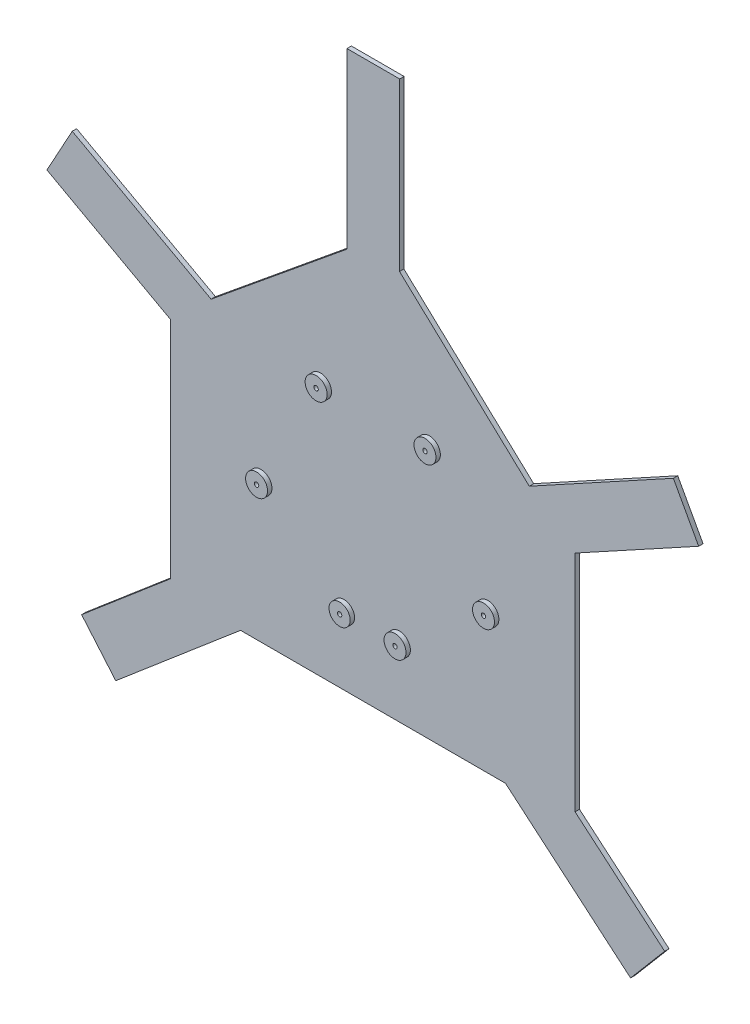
ISO-10303-21;
HEADER;
FILE_DESCRIPTION(('STEP AP214'),'2;1');
FILE_NAME('part.step','',(''),(''),'','','');
FILE_SCHEMA(('AUTOMOTIVE_DESIGN { 1 0 10303 214 1 1 1 1 }'));
ENDSEC;
DATA;
#1=APPLICATION_CONTEXT('core data for automotive mechanical design processes');
#2=APPLICATION_PROTOCOL_DEFINITION('international standard','automotive_design',2000,#1);
#3=PRODUCT_CONTEXT('',#1,'mechanical');
#4=PRODUCT('Part','Part','',(#3));
#5=PRODUCT_RELATED_PRODUCT_CATEGORY('part','',(#4));
#6=PRODUCT_DEFINITION_FORMATION('','',#4);
#7=PRODUCT_DEFINITION_CONTEXT('part definition',#1,'design');
#8=PRODUCT_DEFINITION('design','',#6,#7);
#9=PRODUCT_DEFINITION_SHAPE('','',#8);
#10=(LENGTH_UNIT() NAMED_UNIT(*) SI_UNIT(.MILLI.,.METRE.));
#11=(NAMED_UNIT(*) PLANE_ANGLE_UNIT() SI_UNIT($,.RADIAN.));
#12=(NAMED_UNIT(*) SI_UNIT($,.STERADIAN.) SOLID_ANGLE_UNIT());
#13=UNCERTAINTY_MEASURE_WITH_UNIT(LENGTH_MEASURE(1.E-05),#10,'distance_accuracy_value','');
#14=(GEOMETRIC_REPRESENTATION_CONTEXT(3) GLOBAL_UNCERTAINTY_ASSIGNED_CONTEXT((#13)) GLOBAL_UNIT_ASSIGNED_CONTEXT((#10,
#11,#12)) REPRESENTATION_CONTEXT('',''));
#15=CARTESIAN_POINT('',(0.,0.,0.));
#16=DIRECTION('',(0.,0.,1.));
#17=DIRECTION('',(1.,0.,0.));
#18=AXIS2_PLACEMENT_3D('',#15,#16,#17);
#19=CARTESIAN_POINT('',(0.,12.916249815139,1.));
#20=DIRECTION('',(0.,1.,0.));
#21=DIRECTION('',(-1.,0.,0.));
#22=AXIS2_PLACEMENT_3D('',#19,#20,#21);
#23=PLANE('',#22);
#24=DIRECTION('',(1.,0.,0.));
#25=VECTOR('',#24,1.);
#26=CARTESIAN_POINT('',(0.,12.916249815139,0.));
#27=LINE('',#26,#25);
#28=CARTESIAN_POINT('',(32.7776487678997,12.916249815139,0.));
#29=VERTEX_POINT('',#28);
#30=CARTESIAN_POINT('',(93.0898911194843,12.9162498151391,0.));
#31=VERTEX_POINT('',#30);
#32=EDGE_CURVE('E204',#29,#31,#27,.T.);
#33=ORIENTED_EDGE('',*,*,#32,.T.);
#34=DIRECTION('',(0.,0.,-1.));
#35=VECTOR('',#34,1.);
#36=CARTESIAN_POINT('',(93.0898911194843,12.9162498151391,1.));
#37=LINE('',#36,#35);
#38=CARTESIAN_POINT('',(93.0898911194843,12.9162498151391,1.));
#39=VERTEX_POINT('',#38);
#40=EDGE_CURVE('E11',#39,#31,#37,.T.);
#41=ORIENTED_EDGE('',*,*,#40,.F.);
#42=DIRECTION('',(1.,0.,0.));
#43=VECTOR('',#42,1.);
#44=CARTESIAN_POINT('',(0.,12.916249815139,1.));
#45=LINE('',#44,#43);
#46=CARTESIAN_POINT('',(32.7776487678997,12.916249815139,1.));
#47=VERTEX_POINT('',#46);
#48=EDGE_CURVE('E126',#47,#39,#45,.T.);
#49=ORIENTED_EDGE('',*,*,#48,.F.);
#50=DIRECTION('',(0.,0.,-1.));
#51=VECTOR('',#50,1.);
#52=CARTESIAN_POINT('',(32.7776487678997,12.916249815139,1.));
#53=LINE('',#52,#51);
#54=EDGE_CURVE('E203',#47,#29,#53,.T.);
#55=ORIENTED_EDGE('',*,*,#54,.T.);
#56=EDGE_LOOP('',(#33,#41,#49,#55));
#57=FACE_BOUND('',#56,.T.);
#58=ADVANCED_FACE('F35',(#57),#23,.F.);
#59=CARTESIAN_POINT('',(45.3070454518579,53.4326599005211,1.));
#60=DIRECTION('',(-0.646730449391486,-0.76271864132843,0.));
#61=DIRECTION('',(0.76271864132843,-0.646730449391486,0.));
#62=AXIS2_PLACEMENT_3D('',#59,#60,#61);
#63=PLANE('',#62);
#64=DIRECTION('',(-0.76271864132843,0.646730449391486,0.));
#65=VECTOR('',#64,1.);
#66=CARTESIAN_POINT('',(45.3070454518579,53.4326599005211,0.));
#67=LINE('',#66,#65);
#68=CARTESIAN_POINT('',(121.568198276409,-11.23130262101,0.));
#69=VERTEX_POINT('',#68);
#70=EDGE_CURVE('E207',#69,#31,#67,.T.);
#71=ORIENTED_EDGE('',*,*,#70,.F.);
#72=DIRECTION('',(0.,0.,-1.));
#73=VECTOR('',#72,1.);
#74=CARTESIAN_POINT('',(121.568198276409,-11.23130262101,1.));
#75=LINE('',#74,#73);
#76=CARTESIAN_POINT('',(121.568198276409,-11.23130262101,1.));
#77=VERTEX_POINT('',#76);
#78=EDGE_CURVE('E43',#77,#69,#75,.T.);
#79=ORIENTED_EDGE('',*,*,#78,.F.);
#80=DIRECTION('',(-0.76271864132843,0.646730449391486,0.));
#81=VECTOR('',#80,1.);
#82=CARTESIAN_POINT('',(45.3070454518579,53.4326599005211,1.));
#83=LINE('',#82,#81);
#84=EDGE_CURVE('E316',#77,#39,#83,.T.);
#85=ORIENTED_EDGE('',*,*,#84,.T.);
#86=ORIENTED_EDGE('',*,*,#40,.T.);
#87=EDGE_LOOP('',(#71,#79,#85,#86));
#88=FACE_BOUND('',#87,.T.);
#89=ADVANCED_FACE('F299',(#88),#63,.T.);
#90=CARTESIAN_POINT('',(76.2611528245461,-64.6639625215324,1.));
#91=DIRECTION('',(0.762718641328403,-0.646730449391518,0.));
#92=DIRECTION('',(0.646730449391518,0.762718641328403,0.));
#93=AXIS2_PLACEMENT_3D('',#90,#91,#92);
#94=PLANE('',#93);
#95=DIRECTION('',(-0.646730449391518,-0.762718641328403,0.));
#96=VECTOR('',#95,1.);
#97=CARTESIAN_POINT('',(76.2611528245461,-64.6639625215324,0.));
#98=LINE('',#97,#96);
#99=CARTESIAN_POINT('',(129.328963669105,-2.07867892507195,0.));
#100=VERTEX_POINT('',#99);
#101=EDGE_CURVE('E211',#100,#69,#98,.T.);
#102=ORIENTED_EDGE('',*,*,#101,.F.);
#103=DIRECTION('',(0.,0.,-1.));
#104=VECTOR('',#103,1.);
#105=CARTESIAN_POINT('',(129.328963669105,-2.07867892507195,1.));
#106=LINE('',#105,#104);
#107=CARTESIAN_POINT('',(129.328963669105,-2.07867892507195,1.));
#108=VERTEX_POINT('',#107);
#109=EDGE_CURVE('E289',#108,#100,#106,.T.);
#110=ORIENTED_EDGE('',*,*,#109,.F.);
#111=DIRECTION('',(-0.646730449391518,-0.762718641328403,0.));
#112=VECTOR('',#111,1.);
#113=CARTESIAN_POINT('',(76.2611528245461,-64.6639625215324,1.));
#114=LINE('',#113,#112);
#115=EDGE_CURVE('E296',#108,#77,#114,.T.);
#116=ORIENTED_EDGE('',*,*,#115,.T.);
#117=ORIENTED_EDGE('',*,*,#78,.T.);
#118=EDGE_LOOP('',(#102,#110,#116,#117));
#119=FACE_BOUND('',#118,.T.);
#120=ADVANCED_FACE('F294',(#119),#94,.T.);
#121=CARTESIAN_POINT('',(53.0678108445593,62.5852835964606,1.));
#122=DIRECTION('',(-0.646730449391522,-0.762718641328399,0.));
#123=DIRECTION('',(0.762718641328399,-0.646730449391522,0.));
#124=AXIS2_PLACEMENT_3D('',#121,#122,#123);
#125=PLANE('',#124);
#126=DIRECTION('',(-0.762718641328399,0.646730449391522,0.));
#127=VECTOR('',#126,1.);
#128=CARTESIAN_POINT('',(53.0678108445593,62.5852835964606,0.));
#129=LINE('',#128,#127);
#130=CARTESIAN_POINT('',(108.934318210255,15.2145108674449,0.));
#131=VERTEX_POINT('',#130);
#132=EDGE_CURVE('E214',#100,#131,#129,.T.);
#133=ORIENTED_EDGE('',*,*,#132,.T.);
#134=DIRECTION('',(0.,0.,-1.));
#135=VECTOR('',#134,1.);
#136=CARTESIAN_POINT('',(108.934318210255,15.2145108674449,1.));
#137=LINE('',#136,#135);
#138=CARTESIAN_POINT('',(108.934318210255,15.2145108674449,1.));
#139=VERTEX_POINT('',#138);
#140=EDGE_CURVE('E287',#139,#131,#137,.T.);
#141=ORIENTED_EDGE('',*,*,#140,.F.);
#142=DIRECTION('',(-0.762718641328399,0.646730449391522,0.));
#143=VECTOR('',#142,1.);
#144=CARTESIAN_POINT('',(53.0678108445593,62.5852835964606,1.));
#145=LINE('',#144,#143);
#146=EDGE_CURVE('E312',#108,#139,#145,.T.);
#147=ORIENTED_EDGE('',*,*,#146,.F.);
#148=ORIENTED_EDGE('',*,*,#109,.T.);
#149=EDGE_LOOP('',(#133,#141,#147,#148));
#150=FACE_BOUND('',#149,.T.);
#151=ADVANCED_FACE('F309',(#150),#125,.F.);
#152=CARTESIAN_POINT('',(108.934318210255,0.,1.));
#153=DIRECTION('',(1.,0.,0.));
#154=DIRECTION('',(0.,0.,-1.));
#155=AXIS2_PLACEMENT_3D('',#152,#153,#154);
#156=PLANE('',#155);
#157=DIRECTION('',(0.,-1.,0.));
#158=VECTOR('',#157,1.);
#159=CARTESIAN_POINT('',(108.934318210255,0.,0.));
#160=LINE('',#159,#158);
#161=CARTESIAN_POINT('',(108.934318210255,66.2255841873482,0.));
#162=VERTEX_POINT('',#161);
#163=EDGE_CURVE('E217',#162,#131,#160,.T.);
#164=ORIENTED_EDGE('',*,*,#163,.F.);
#165=DIRECTION('',(0.,0.,-1.));
#166=VECTOR('',#165,1.);
#167=CARTESIAN_POINT('',(108.934318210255,66.2255841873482,1.));
#168=LINE('',#167,#166);
#169=CARTESIAN_POINT('',(108.934318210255,66.2255841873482,1.));
#170=VERTEX_POINT('',#169);
#171=EDGE_CURVE('E285',#170,#162,#168,.T.);
#172=ORIENTED_EDGE('',*,*,#171,.F.);
#173=DIRECTION('',(0.,-1.,0.));
#174=VECTOR('',#173,1.);
#175=CARTESIAN_POINT('',(108.934318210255,0.,1.));
#176=LINE('',#175,#174);
#177=EDGE_CURVE('E314',#170,#139,#176,.T.);
#178=ORIENTED_EDGE('',*,*,#177,.T.);
#179=ORIENTED_EDGE('',*,*,#140,.T.);
#180=EDGE_LOOP('',(#164,#172,#178,#179));
#181=FACE_BOUND('',#180,.T.);
#182=ADVANCED_FACE('F789',(#181),#156,.T.);
#183=CARTESIAN_POINT('',(-2.76864157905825,5.0558581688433,1.));
#184=DIRECTION('',(-0.480308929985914,0.87709938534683,0.));
#185=DIRECTION('',(-0.87709938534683,-0.480308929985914,0.));
#186=AXIS2_PLACEMENT_3D('',#183,#184,#185);
#187=PLANE('',#186);
#188=DIRECTION('',(0.87709938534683,0.480308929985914,0.));
#189=VECTOR('',#188,1.);
#190=CARTESIAN_POINT('',(-2.76864157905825,5.0558581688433,0.));
#191=LINE('',#190,#189);
#192=CARTESIAN_POINT('',(137.073736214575,81.6350280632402,0.));
#193=VERTEX_POINT('',#192);
#194=EDGE_CURVE('E220',#162,#193,#191,.T.);
#195=ORIENTED_EDGE('',*,*,#194,.T.);
#196=DIRECTION('',(0.,0.,-1.));
#197=VECTOR('',#196,1.);
#198=CARTESIAN_POINT('',(137.073736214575,81.6350280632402,1.));
#199=LINE('',#198,#197);
#200=CARTESIAN_POINT('',(137.073736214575,81.6350280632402,1.));
#201=VERTEX_POINT('',#200);
#202=EDGE_CURVE('E283',#201,#193,#199,.T.);
#203=ORIENTED_EDGE('',*,*,#202,.F.);
#204=DIRECTION('',(0.87709938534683,0.480308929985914,0.));
#205=VECTOR('',#204,1.);
#206=CARTESIAN_POINT('',(-2.76864157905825,5.0558581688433,1.));
#207=LINE('',#206,#205);
#208=EDGE_CURVE('E322',#170,#201,#207,.T.);
#209=ORIENTED_EDGE('',*,*,#208,.F.);
#210=ORIENTED_EDGE('',*,*,#171,.T.);
#211=EDGE_LOOP('',(#195,#203,#209,#210));
#212=FACE_BOUND('',#211,.T.);
#213=ADVANCED_FACE('F779',(#212),#187,.F.);
#214=CARTESIAN_POINT('',(139.842377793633,76.5791698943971,1.));
#215=DIRECTION('',(0.877099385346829,0.480308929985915,0.));
#216=DIRECTION('',(-0.480308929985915,0.877099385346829,0.));
#217=AXIS2_PLACEMENT_3D('',#214,#215,#216);
#218=PLANE('',#217);
#219=DIRECTION('',(0.480308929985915,-0.877099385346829,0.));
#220=VECTOR('',#219,1.);
#221=CARTESIAN_POINT('',(139.842377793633,76.5791698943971,0.));
#222=LINE('',#221,#220);
#223=CARTESIAN_POINT('',(131.310029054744,92.1602206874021,0.));
#224=VERTEX_POINT('',#223);
#225=EDGE_CURVE('E223',#224,#193,#222,.T.);
#226=ORIENTED_EDGE('',*,*,#225,.F.);
#227=DIRECTION('',(0.,0.,-1.));
#228=VECTOR('',#227,1.);
#229=CARTESIAN_POINT('',(131.310029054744,92.1602206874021,1.));
#230=LINE('',#229,#228);
#231=CARTESIAN_POINT('',(131.310029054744,92.1602206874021,1.));
#232=VERTEX_POINT('',#231);
#233=EDGE_CURVE('E281',#232,#224,#230,.T.);
#234=ORIENTED_EDGE('',*,*,#233,.F.);
#235=DIRECTION('',(0.480308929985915,-0.877099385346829,0.));
#236=VECTOR('',#235,1.);
#237=CARTESIAN_POINT('',(139.842377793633,76.5791698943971,1.));
#238=LINE('',#237,#236);
#239=EDGE_CURVE('E324',#232,#201,#238,.T.);
#240=ORIENTED_EDGE('',*,*,#239,.T.);
#241=ORIENTED_EDGE('',*,*,#202,.T.);
#242=EDGE_LOOP('',(#226,#234,#240,#241));
#243=FACE_BOUND('',#242,.T.);
#244=ADVANCED_FACE('F768',(#243),#218,.T.);
#245=CARTESIAN_POINT('',(-8.53234873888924,15.5810507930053,1.));
#246=DIRECTION('',(-0.480308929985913,0.87709938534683,0.));
#247=DIRECTION('',(-0.87709938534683,-0.480308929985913,0.));
#248=AXIS2_PLACEMENT_3D('',#245,#246,#247);
#249=PLANE('',#248);
#250=DIRECTION('',(0.87709938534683,0.480308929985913,0.));
#251=VECTOR('',#250,1.);
#252=CARTESIAN_POINT('',(-8.53234873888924,15.5810507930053,0.));
#253=LINE('',#252,#251);
#254=CARTESIAN_POINT('',(98.5147792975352,74.2011939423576,0.));
#255=VERTEX_POINT('',#254);
#256=EDGE_CURVE('E226',#255,#224,#253,.T.);
#257=ORIENTED_EDGE('',*,*,#256,.F.);
#258=DIRECTION('',(0.,0.,-1.));
#259=VECTOR('',#258,1.);
#260=CARTESIAN_POINT('',(98.5147792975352,74.2011939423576,1.));
#261=LINE('',#260,#259);
#262=CARTESIAN_POINT('',(98.5147792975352,74.2011939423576,1.));
#263=VERTEX_POINT('',#262);
#264=EDGE_CURVE('E279',#263,#255,#261,.T.);
#265=ORIENTED_EDGE('',*,*,#264,.F.);
#266=DIRECTION('',(0.87709938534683,0.480308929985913,0.));
#267=VECTOR('',#266,1.);
#268=CARTESIAN_POINT('',(-8.53234873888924,15.5810507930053,1.));
#269=LINE('',#268,#267);
#270=EDGE_CURVE('E327',#263,#232,#269,.T.);
#271=ORIENTED_EDGE('',*,*,#270,.T.);
#272=ORIENTED_EDGE('',*,*,#233,.T.);
#273=EDGE_LOOP('',(#257,#265,#271,#272));
#274=FACE_BOUND('',#273,.T.);
#275=ADVANCED_FACE('F757',(#274),#249,.T.);
#276=CARTESIAN_POINT('',(82.8315829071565,88.8260092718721,1.));
#277=DIRECTION('',(0.681998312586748,0.731353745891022,0.));
#278=DIRECTION('',(-0.731353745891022,0.681998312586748,0.));
#279=AXIS2_PLACEMENT_3D('',#276,#277,#278);
#280=PLANE('',#279);
#281=DIRECTION('',(0.731353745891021,-0.681998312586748,0.));
#282=VECTOR('',#281,1.);
#283=CARTESIAN_POINT('',(82.8315829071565,88.8260092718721,0.));
#284=LINE('',#283,#282);
#285=CARTESIAN_POINT('',(68.9652836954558,101.756540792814,0.));
#286=VERTEX_POINT('',#285);
#287=EDGE_CURVE('E229',#286,#255,#284,.T.);
#288=ORIENTED_EDGE('',*,*,#287,.F.);
#289=DIRECTION('',(0.,0.,-1.));
#290=VECTOR('',#289,1.);
#291=CARTESIAN_POINT('',(68.9652836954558,101.756540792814,1.));
#292=LINE('',#291,#290);
#293=CARTESIAN_POINT('',(68.9652836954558,101.756540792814,1.));
#294=VERTEX_POINT('',#293);
#295=EDGE_CURVE('E277',#294,#286,#292,.T.);
#296=ORIENTED_EDGE('',*,*,#295,.F.);
#297=DIRECTION('',(0.731353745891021,-0.681998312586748,0.));
#298=VECTOR('',#297,1.);
#299=CARTESIAN_POINT('',(82.8315829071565,88.8260092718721,1.));
#300=LINE('',#299,#298);
#301=EDGE_CURVE('E330',#294,#263,#300,.T.);
#302=ORIENTED_EDGE('',*,*,#301,.T.);
#303=ORIENTED_EDGE('',*,*,#264,.T.);
#304=EDGE_LOOP('',(#288,#296,#302,#303));
#305=FACE_BOUND('',#304,.T.);
#306=ADVANCED_FACE('F747',(#305),#280,.T.);
#307=CARTESIAN_POINT('',(68.8422143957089,-0.0831930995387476,1.));
#308=DIRECTION('',(-0.999999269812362,0.00120845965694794,0.));
#309=DIRECTION('',(-0.00120845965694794,-0.999999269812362,0.));
#310=AXIS2_PLACEMENT_3D('',#307,#308,#309);
#311=PLANE('',#310);
#312=DIRECTION('',(0.00120845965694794,0.999999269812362,0.));
#313=VECTOR('',#312,1.);
#314=CARTESIAN_POINT('',(68.8422143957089,-0.0831930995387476,0.));
#315=LINE('',#314,#313);
#316=CARTESIAN_POINT('',(69.0111793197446,139.735128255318,0.));
#317=VERTEX_POINT('',#316);
#318=EDGE_CURVE('E232',#286,#317,#315,.T.);
#319=ORIENTED_EDGE('',*,*,#318,.T.);
#320=DIRECTION('',(0.,0.,-1.));
#321=VECTOR('',#320,1.);
#322=CARTESIAN_POINT('',(69.0111793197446,139.735128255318,1.));
#323=LINE('',#322,#321);
#324=CARTESIAN_POINT('',(69.0111793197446,139.735128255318,1.));
#325=VERTEX_POINT('',#324);
#326=EDGE_CURVE('E275',#325,#317,#323,.T.);
#327=ORIENTED_EDGE('',*,*,#326,.F.);
#328=DIRECTION('',(0.00120845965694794,0.999999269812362,0.));
#329=VECTOR('',#328,1.);
#330=CARTESIAN_POINT('',(68.8422143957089,-0.0831930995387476,1.));
#331=LINE('',#330,#329);
#332=EDGE_CURVE('E333',#294,#325,#331,.T.);
#333=ORIENTED_EDGE('',*,*,#332,.F.);
#334=ORIENTED_EDGE('',*,*,#295,.T.);
#335=EDGE_LOOP('',(#319,#327,#333,#334));
#336=FACE_BOUND('',#335,.T.);
#337=ADVANCED_FACE('F737',(#336),#311,.F.);
#338=CARTESIAN_POINT('',(0.,139.735128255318,1.));
#339=DIRECTION('',(0.,1.,0.));
#340=DIRECTION('',(0.,0.,1.));
#341=AXIS2_PLACEMENT_3D('',#338,#339,#340);
#342=PLANE('',#341);
#343=DIRECTION('',(1.,0.,0.));
#344=VECTOR('',#343,1.);
#345=CARTESIAN_POINT('',(0.,139.735128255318,0.));
#346=LINE('',#345,#344);
#347=CARTESIAN_POINT('',(57.0111705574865,139.735128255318,0.));
#348=VERTEX_POINT('',#347);
#349=EDGE_CURVE('E235',#348,#317,#346,.T.);
#350=ORIENTED_EDGE('',*,*,#349,.F.);
#351=DIRECTION('',(0.,0.,-1.));
#352=VECTOR('',#351,1.);
#353=CARTESIAN_POINT('',(57.0111705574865,139.735128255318,1.));
#354=LINE('',#353,#352);
#355=CARTESIAN_POINT('',(57.0111705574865,139.735128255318,1.));
#356=VERTEX_POINT('',#355);
#357=EDGE_CURVE('E273',#356,#348,#354,.T.);
#358=ORIENTED_EDGE('',*,*,#357,.F.);
#359=DIRECTION('',(1.,0.,0.));
#360=VECTOR('',#359,1.);
#361=CARTESIAN_POINT('',(0.,139.735128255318,1.));
#362=LINE('',#361,#360);
#363=EDGE_CURVE('E335',#356,#325,#362,.T.);
#364=ORIENTED_EDGE('',*,*,#363,.T.);
#365=ORIENTED_EDGE('',*,*,#326,.T.);
#366=EDGE_LOOP('',(#350,#358,#364,#365));
#367=FACE_BOUND('',#366,.T.);
#368=ADVANCED_FACE('F727',(#367),#342,.T.);
#369=CARTESIAN_POINT('',(56.8422231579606,-0.0686915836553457,1.));
#370=DIRECTION('',(-0.999999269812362,0.00120845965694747,0.));
#371=DIRECTION('',(-0.00120845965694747,-0.999999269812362,0.));
#372=AXIS2_PLACEMENT_3D('',#369,#370,#371);
#373=PLANE('',#372);
#374=DIRECTION('',(0.00120845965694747,0.999999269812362,0.));
#375=VECTOR('',#374,1.);
#376=CARTESIAN_POINT('',(56.8422231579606,-0.0686915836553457,0.));
#377=LINE('',#376,#375);
#378=CARTESIAN_POINT('',(56.9633273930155,100.144953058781,0.));
#379=VERTEX_POINT('',#378);
#380=EDGE_CURVE('E238',#379,#348,#377,.T.);
#381=ORIENTED_EDGE('',*,*,#380,.F.);
#382=DIRECTION('',(0.,0.,-1.));
#383=VECTOR('',#382,1.);
#384=CARTESIAN_POINT('',(56.9633273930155,100.144953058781,1.));
#385=LINE('',#384,#383);
#386=CARTESIAN_POINT('',(56.9633273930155,100.144953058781,1.));
#387=VERTEX_POINT('',#386);
#388=EDGE_CURVE('E271',#387,#379,#385,.T.);
#389=ORIENTED_EDGE('',*,*,#388,.F.);
#390=DIRECTION('',(0.00120845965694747,0.999999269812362,0.));
#391=VECTOR('',#390,1.);
#392=CARTESIAN_POINT('',(56.8422231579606,-0.0686915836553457,1.));
#393=LINE('',#392,#391);
#394=EDGE_CURVE('E338',#387,#356,#393,.T.);
#395=ORIENTED_EDGE('',*,*,#394,.T.);
#396=ORIENTED_EDGE('',*,*,#357,.T.);
#397=EDGE_LOOP('',(#381,#389,#395,#396));
#398=FACE_BOUND('',#397,.T.);
#399=ADVANCED_FACE('F716',(#398),#373,.T.);
#400=CARTESIAN_POINT('',(-26.2235755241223,32.0226877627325,1.));
#401=DIRECTION('',(-0.633573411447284,0.773682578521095,0.));
#402=DIRECTION('',(-0.773682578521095,-0.633573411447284,0.));
#403=AXIS2_PLACEMENT_3D('',#400,#401,#402);
#404=PLANE('',#403);
#405=DIRECTION('',(0.773682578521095,0.633573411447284,0.));
#406=VECTOR('',#405,1.);
#407=CARTESIAN_POINT('',(-26.2235755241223,32.0226877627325,0.));
#408=LINE('',#407,#406);
#409=CARTESIAN_POINT('',(26.0767204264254,74.8517210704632,0.));
#410=VERTEX_POINT('',#409);
#411=EDGE_CURVE('E241',#410,#379,#408,.T.);
#412=ORIENTED_EDGE('',*,*,#411,.F.);
#413=DIRECTION('',(0.,0.,-1.));
#414=VECTOR('',#413,1.);
#415=CARTESIAN_POINT('',(26.0767204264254,74.8517210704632,1.));
#416=LINE('',#415,#414);
#417=CARTESIAN_POINT('',(26.0767204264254,74.8517210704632,1.));
#418=VERTEX_POINT('',#417);
#419=EDGE_CURVE('E269',#418,#410,#416,.T.);
#420=ORIENTED_EDGE('',*,*,#419,.F.);
#421=DIRECTION('',(0.773682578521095,0.633573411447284,0.));
#422=VECTOR('',#421,1.);
#423=CARTESIAN_POINT('',(-26.2235755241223,32.0226877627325,1.));
#424=LINE('',#423,#422);
#425=EDGE_CURVE('E341',#418,#387,#424,.T.);
#426=ORIENTED_EDGE('',*,*,#425,.T.);
#427=ORIENTED_EDGE('',*,*,#388,.T.);
#428=EDGE_LOOP('',(#412,#420,#426,#427));
#429=FACE_BOUND('',#428,.T.);
#430=ADVANCED_FACE('F706',(#429),#404,.T.);
#431=CARTESIAN_POINT('',(37.5471036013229,68.5709303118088,1.));
#432=DIRECTION('',(-0.480278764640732,-0.877115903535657,0.));
#433=DIRECTION('',(0.877115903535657,-0.480278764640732,0.));
#434=AXIS2_PLACEMENT_3D('',#431,#432,#433);
#435=PLANE('',#434);
#436=DIRECTION('',(-0.877115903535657,0.480278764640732,0.));
#437=VECTOR('',#436,1.);
#438=CARTESIAN_POINT('',(37.5471036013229,68.5709303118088,0.));
#439=LINE('',#438,#437);
#440=CARTESIAN_POINT('',(-5.53344914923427,92.1603722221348,0.));
#441=VERTEX_POINT('',#440);
#442=EDGE_CURVE('E244',#410,#441,#439,.T.);
#443=ORIENTED_EDGE('',*,*,#442,.T.);
#444=DIRECTION('',(0.,0.,-1.));
#445=VECTOR('',#444,1.);
#446=CARTESIAN_POINT('',(-5.53344914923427,92.1603722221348,1.));
#447=LINE('',#446,#445);
#448=CARTESIAN_POINT('',(-5.53344914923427,92.1603722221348,1.));
#449=VERTEX_POINT('',#448);
#450=EDGE_CURVE('E266',#449,#441,#447,.T.);
#451=ORIENTED_EDGE('',*,*,#450,.F.);
#452=DIRECTION('',(-0.877115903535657,0.480278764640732,0.));
#453=VECTOR('',#452,1.);
#454=CARTESIAN_POINT('',(37.5471036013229,68.5709303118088,1.));
#455=LINE('',#454,#453);
#456=EDGE_CURVE('E344',#418,#449,#455,.T.);
#457=ORIENTED_EDGE('',*,*,#456,.F.);
#458=ORIENTED_EDGE('',*,*,#419,.T.);
#459=EDGE_LOOP('',(#443,#451,#457,#458));
#460=FACE_BOUND('',#459,.T.);
#461=ADVANCED_FACE('F697',(#460),#435,.F.);
#462=CARTESIAN_POINT('',(-43.0805527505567,23.5894419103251,1.));
#463=DIRECTION('',(0.877115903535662,-0.480278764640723,0.));
#464=DIRECTION('',(0.480278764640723,0.877115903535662,0.));
#465=AXIS2_PLACEMENT_3D('',#462,#463,#464);
#466=PLANE('',#465);
#467=DIRECTION('',(-0.480278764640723,-0.877115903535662,0.));
#468=VECTOR('',#467,1.);
#469=CARTESIAN_POINT('',(-43.0805527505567,23.5894419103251,0.));
#470=LINE('',#469,#468);
#471=CARTESIAN_POINT('',(-11.2967943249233,81.6349813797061,0.));
#472=VERTEX_POINT('',#471);
#473=EDGE_CURVE('E246',#441,#472,#470,.T.);
#474=ORIENTED_EDGE('',*,*,#473,.T.);
#475=DIRECTION('',(0.,0.,-1.));
#476=VECTOR('',#475,1.);
#477=CARTESIAN_POINT('',(-11.2967943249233,81.6349813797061,1.));
#478=LINE('',#477,#476);
#479=CARTESIAN_POINT('',(-11.2967943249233,81.6349813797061,1.));
#480=VERTEX_POINT('',#479);
#481=EDGE_CURVE('E264',#480,#472,#478,.T.);
#482=ORIENTED_EDGE('',*,*,#481,.F.);
#483=DIRECTION('',(-0.480278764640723,-0.877115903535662,0.));
#484=VECTOR('',#483,1.);
#485=CARTESIAN_POINT('',(-43.0805527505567,23.5894419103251,1.));
#486=LINE('',#485,#484);
#487=EDGE_CURVE('E346',#449,#480,#486,.T.);
#488=ORIENTED_EDGE('',*,*,#487,.F.);
#489=ORIENTED_EDGE('',*,*,#450,.T.);
#490=EDGE_LOOP('',(#474,#482,#488,#489));
#491=FACE_BOUND('',#490,.T.);
#492=ADVANCED_FACE('F357',(#491),#466,.F.);
#493=CARTESIAN_POINT('',(31.783758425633,58.0455394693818,1.));
#494=DIRECTION('',(-0.480278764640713,-0.877115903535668,0.));
#495=DIRECTION('',(0.877115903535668,-0.480278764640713,0.));
#496=AXIS2_PLACEMENT_3D('',#493,#494,#495);
#497=PLANE('',#496);
#498=DIRECTION('',(-0.877115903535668,0.480278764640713,0.));
#499=VECTOR('',#498,1.);
#500=CARTESIAN_POINT('',(31.783758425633,58.0455394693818,0.));
#501=LINE('',#500,#499);
#502=CARTESIAN_POINT('',(16.844878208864,66.2255609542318,0.));
#503=VERTEX_POINT('',#502);
#504=EDGE_CURVE('E249',#503,#472,#501,.T.);
#505=ORIENTED_EDGE('',*,*,#504,.F.);
#506=DIRECTION('',(0.,0.,-1.));
#507=VECTOR('',#506,1.);
#508=CARTESIAN_POINT('',(16.844878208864,66.2255609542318,1.));
#509=LINE('',#508,#507);
#510=CARTESIAN_POINT('',(16.844878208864,66.2255609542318,1.));
#511=VERTEX_POINT('',#510);
#512=EDGE_CURVE('E262',#511,#503,#509,.T.);
#513=ORIENTED_EDGE('',*,*,#512,.F.);
#514=DIRECTION('',(-0.877115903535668,0.480278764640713,0.));
#515=VECTOR('',#514,1.);
#516=CARTESIAN_POINT('',(31.783758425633,58.0455394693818,1.));
#517=LINE('',#516,#515);
#518=EDGE_CURVE('E198',#511,#480,#517,.T.);
#519=ORIENTED_EDGE('',*,*,#518,.T.);
#520=ORIENTED_EDGE('',*,*,#481,.T.);
#521=EDGE_LOOP('',(#505,#513,#519,#520));
#522=FACE_BOUND('',#521,.T.);
#523=ADVANCED_FACE('F350',(#522),#497,.T.);
#524=CARTESIAN_POINT('',(16.844878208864,0.,1.));
#525=DIRECTION('',(1.,0.,0.));
#526=DIRECTION('',(0.,1.,0.));
#527=AXIS2_PLACEMENT_3D('',#524,#525,#526);
#528=PLANE('',#527);
#529=DIRECTION('',(0.,-1.,0.));
#530=VECTOR('',#529,1.);
#531=CARTESIAN_POINT('',(16.844878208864,0.,0.));
#532=LINE('',#531,#530);
#533=CARTESIAN_POINT('',(16.844878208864,15.1251795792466,0.));
#534=VERTEX_POINT('',#533);
#535=EDGE_CURVE('E252',#503,#534,#532,.T.);
#536=ORIENTED_EDGE('',*,*,#535,.T.);
#537=DIRECTION('',(0.,0.,-1.));
#538=VECTOR('',#537,1.);
#539=CARTESIAN_POINT('',(16.844878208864,15.1251795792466,1.));
#540=LINE('',#539,#538);
#541=CARTESIAN_POINT('',(16.844878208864,15.1251795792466,1.));
#542=VERTEX_POINT('',#541);
#543=EDGE_CURVE('E186',#542,#534,#540,.T.);
#544=ORIENTED_EDGE('',*,*,#543,.F.);
#545=DIRECTION('',(0.,-1.,0.));
#546=VECTOR('',#545,1.);
#547=CARTESIAN_POINT('',(16.844878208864,0.,1.));
#548=LINE('',#547,#546);
#549=EDGE_CURVE('E195',#511,#542,#548,.T.);
#550=ORIENTED_EDGE('',*,*,#549,.F.);
#551=ORIENTED_EDGE('',*,*,#512,.T.);
#552=EDGE_LOOP('',(#536,#544,#550,#551));
#553=FACE_BOUND('',#552,.T.);
#554=ADVANCED_FACE('F362',(#553),#528,.F.);
#555=CARTESIAN_POINT('',(-0.400767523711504,0.471661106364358,1.));
#556=DIRECTION('',(-0.647512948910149,0.762054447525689,0.));
#557=DIRECTION('',(-0.762054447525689,-0.647512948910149,0.));
#558=AXIS2_PLACEMENT_3D('',#555,#556,#557);
#559=PLANE('',#558);
#560=DIRECTION('',(0.762054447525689,0.647512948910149,0.));
#561=VECTOR('',#560,1.);
#562=CARTESIAN_POINT('',(-0.400767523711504,0.471661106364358,0.));
#563=LINE('',#562,#561);
#564=CARTESIAN_POINT('',(-3.40395136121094,-2.08012561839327,0.));
#565=VERTEX_POINT('',#564);
#566=EDGE_CURVE('E185',#565,#534,#563,.T.);
#567=ORIENTED_EDGE('',*,*,#566,.F.);
#568=DIRECTION('',(0.,0.,-1.));
#569=VECTOR('',#568,1.);
#570=CARTESIAN_POINT('',(-3.40395136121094,-2.08012561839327,1.));
#571=LINE('',#570,#569);
#572=CARTESIAN_POINT('',(-3.40395136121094,-2.08012561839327,1.));
#573=VERTEX_POINT('',#572);
#574=EDGE_CURVE('E179',#573,#565,#571,.T.);
#575=ORIENTED_EDGE('',*,*,#574,.F.);
#576=DIRECTION('',(0.762054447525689,0.647512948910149,0.));
#577=VECTOR('',#576,1.);
#578=CARTESIAN_POINT('',(-0.400767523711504,0.471661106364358,1.));
#579=LINE('',#578,#577);
#580=EDGE_CURVE('E183',#573,#542,#579,.T.);
#581=ORIENTED_EDGE('',*,*,#580,.T.);
#582=ORIENTED_EDGE('',*,*,#543,.T.);
#583=EDGE_LOOP('',(#567,#575,#581,#582));
#584=FACE_BOUND('',#583,.T.);
#585=ADVANCED_FACE('F181',(#584),#559,.T.);
#586=CARTESIAN_POINT('',(-3.00318383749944,-2.55178672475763,1.));
#587=DIRECTION('',(0.762054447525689,0.647512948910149,0.));
#588=DIRECTION('',(-0.647512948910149,0.762054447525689,0.));
#589=AXIS2_PLACEMENT_3D('',#586,#587,#588);
#590=PLANE('',#589);
#591=DIRECTION('',(0.647512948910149,-0.762054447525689,0.));
#592=VECTOR('',#591,1.);
#593=CARTESIAN_POINT('',(-3.00318383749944,-2.55178672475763,0.));
#594=LINE('',#593,#592);
#595=CARTESIAN_POINT('',(4.36620402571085,-11.2247789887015,0.));
#596=VERTEX_POINT('',#595);
#597=EDGE_CURVE('E114',#565,#596,#594,.T.);
#598=ORIENTED_EDGE('',*,*,#597,.T.);
#599=DIRECTION('',(0.,0.,-1.));
#600=VECTOR('',#599,1.);
#601=CARTESIAN_POINT('',(4.36620402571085,-11.2247789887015,1.));
#602=LINE('',#601,#600);
#603=CARTESIAN_POINT('',(4.36620402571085,-11.2247789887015,1.));
#604=VERTEX_POINT('',#603);
#605=EDGE_CURVE('E187',#604,#596,#602,.T.);
#606=ORIENTED_EDGE('',*,*,#605,.F.);
#607=DIRECTION('',(0.647512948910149,-0.762054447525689,0.));
#608=VECTOR('',#607,1.);
#609=CARTESIAN_POINT('',(-3.00318383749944,-2.55178672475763,1.));
#610=LINE('',#609,#608);
#611=EDGE_CURVE('E189',#573,#604,#610,.T.);
#612=ORIENTED_EDGE('',*,*,#611,.F.);
#613=ORIENTED_EDGE('',*,*,#574,.T.);
#614=EDGE_LOOP('',(#598,#606,#612,#613));
#615=FACE_BOUND('',#614,.T.);
#616=ADVANCED_FACE('F190',(#615),#590,.F.);
#617=CARTESIAN_POINT('',(7.36938786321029,-8.67299226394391,1.));
#618=DIRECTION('',(-0.647512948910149,0.762054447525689,0.));
#619=DIRECTION('',(-0.762054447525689,-0.647512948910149,0.));
#620=AXIS2_PLACEMENT_3D('',#617,#618,#619);
#621=PLANE('',#620);
#622=DIRECTION('',(0.762054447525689,0.647512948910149,0.));
#623=VECTOR('',#622,1.);
#624=CARTESIAN_POINT('',(7.36938786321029,-8.67299226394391,0.));
#625=LINE('',#624,#623);
#626=EDGE_CURVE('E120',#596,#29,#625,.T.);
#627=ORIENTED_EDGE('',*,*,#626,.T.);
#628=ORIENTED_EDGE('',*,*,#54,.F.);
#629=DIRECTION('',(0.762054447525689,0.647512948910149,0.));
#630=VECTOR('',#629,1.);
#631=CARTESIAN_POINT('',(7.36938786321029,-8.67299226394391,1.));
#632=LINE('',#631,#630);
#633=EDGE_CURVE('E51',#604,#47,#632,.T.);
#634=ORIENTED_EDGE('',*,*,#633,.F.);
#635=ORIENTED_EDGE('',*,*,#605,.T.);
#636=EDGE_LOOP('',(#627,#628,#634,#635));
#637=FACE_BOUND('',#636,.T.);
#638=ADVANCED_FACE('F376',(#637),#621,.F.);
#639=CARTESIAN_POINT('',(0.,0.,1.));
#640=DIRECTION('',(0.,0.,1.));
#641=DIRECTION('',(1.,0.,0.));
#642=AXIS2_PLACEMENT_3D('',#639,#640,#641);
#643=PLANE('',#642);
#644=CARTESIAN_POINT('',(75.7671113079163,70.2664449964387,1.));
#645=DIRECTION('',(0.,0.,1.));
#646=DIRECTION('',(1.,0.,0.));
#647=AXIS2_PLACEMENT_3D('',#644,#645,#646);
#648=CIRCLE('',#647,2.5);
#649=CARTESIAN_POINT('',(78.2671113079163,70.2664449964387,1.));
#650=VERTEX_POINT('',#649);
#651=EDGE_CURVE('E258',#650,#650,#648,.T.);
#652=ORIENTED_EDGE('',*,*,#651,.F.);
#653=EDGE_LOOP('',(#652));
#654=FACE_BOUND('',#653,.T.);
#655=CARTESIAN_POINT('',(50.9833949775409,70.2664449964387,1.));
#656=DIRECTION('',(0.,0.,1.));
#657=DIRECTION('',(1.,0.,0.));
#658=AXIS2_PLACEMENT_3D('',#655,#656,#657);
#659=CIRCLE('',#658,2.5);
#660=CARTESIAN_POINT('',(53.4833949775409,70.2664449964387,1.));
#661=VERTEX_POINT('',#660);
#662=EDGE_CURVE('E522',#661,#661,#659,.T.);
#663=ORIENTED_EDGE('',*,*,#662,.F.);
#664=EDGE_LOOP('',(#663));
#665=FACE_BOUND('',#664,.T.);
#666=CARTESIAN_POINT('',(89.0901052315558,44.4687618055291,1.));
#667=DIRECTION('',(0.,0.,1.));
#668=DIRECTION('',(1.,0.,0.));
#669=AXIS2_PLACEMENT_3D('',#666,#667,#668);
#670=CIRCLE('',#669,2.5);
#671=CARTESIAN_POINT('',(91.5901052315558,44.4687618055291,1.));
#672=VERTEX_POINT('',#671);
#673=EDGE_CURVE('E525',#672,#672,#670,.T.);
#674=ORIENTED_EDGE('',*,*,#673,.F.);
#675=EDGE_LOOP('',(#674));
#676=FACE_BOUND('',#675,.T.);
#677=CARTESIAN_POINT('',(37.4272905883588,44.4687618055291,1.));
#678=DIRECTION('',(0.,0.,1.));
#679=DIRECTION('',(1.,0.,0.));
#680=AXIS2_PLACEMENT_3D('',#677,#678,#679);
#681=CIRCLE('',#680,2.5);
#682=CARTESIAN_POINT('',(39.9272905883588,44.4687618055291,1.));
#683=VERTEX_POINT('',#682);
#684=EDGE_CURVE('E528',#683,#683,#681,.T.);
#685=ORIENTED_EDGE('',*,*,#684,.F.);
#686=EDGE_LOOP('',(#685));
#687=FACE_BOUND('',#686,.T.);
#688=CARTESIAN_POINT('',(68.9454660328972,28.372721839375,1.));
#689=DIRECTION('',(0.,0.,1.));
#690=DIRECTION('',(1.,0.,0.));
#691=AXIS2_PLACEMENT_3D('',#688,#689,#690);
#692=CIRCLE('',#691,2.5);
#693=CARTESIAN_POINT('',(71.4454660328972,28.372721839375,1.));
#694=VERTEX_POINT('',#693);
#695=EDGE_CURVE('E531',#694,#694,#692,.T.);
#696=ORIENTED_EDGE('',*,*,#695,.F.);
#697=EDGE_LOOP('',(#696));
#698=FACE_BOUND('',#697,.T.);
#699=CARTESIAN_POINT('',(56.3281904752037,28.372721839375,1.));
#700=DIRECTION('',(0.,0.,1.));
#701=DIRECTION('',(1.,0.,0.));
#702=AXIS2_PLACEMENT_3D('',#699,#700,#701);
#703=CIRCLE('',#702,2.4085176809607);
#704=CARTESIAN_POINT('',(58.7367081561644,28.372721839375,1.));
#705=VERTEX_POINT('',#704);
#706=EDGE_CURVE('E534',#705,#705,#703,.T.);
#707=ORIENTED_EDGE('',*,*,#706,.F.);
#708=EDGE_LOOP('',(#707));
#709=FACE_BOUND('',#708,.T.);
#710=ORIENTED_EDGE('',*,*,#48,.T.);
#711=ORIENTED_EDGE('',*,*,#84,.F.);
#712=ORIENTED_EDGE('',*,*,#115,.F.);
#713=ORIENTED_EDGE('',*,*,#146,.T.);
#714=ORIENTED_EDGE('',*,*,#177,.F.);
#715=ORIENTED_EDGE('',*,*,#208,.T.);
#716=ORIENTED_EDGE('',*,*,#239,.F.);
#717=ORIENTED_EDGE('',*,*,#270,.F.);
#718=ORIENTED_EDGE('',*,*,#301,.F.);
#719=ORIENTED_EDGE('',*,*,#332,.T.);
#720=ORIENTED_EDGE('',*,*,#363,.F.);
#721=ORIENTED_EDGE('',*,*,#394,.F.);
#722=ORIENTED_EDGE('',*,*,#425,.F.);
#723=ORIENTED_EDGE('',*,*,#456,.T.);
#724=ORIENTED_EDGE('',*,*,#487,.T.);
#725=ORIENTED_EDGE('',*,*,#518,.F.);
#726=ORIENTED_EDGE('',*,*,#549,.T.);
#727=ORIENTED_EDGE('',*,*,#580,.F.);
#728=ORIENTED_EDGE('',*,*,#611,.T.);
#729=ORIENTED_EDGE('',*,*,#633,.T.);
#730=EDGE_LOOP('',(#710,#711,#712,#713,#714,#715,#716,#717,#718,#719,#720,#721,#722,#723,#724,
#725,#726,#727,#728,#729));
#731=FACE_BOUND('',#730,.T.);
#732=ADVANCED_FACE('F192',(#654,#665,#676,#687,#698,#709,#731),#643,.T.);
#733=CARTESIAN_POINT('',(0.,0.,0.));
#734=DIRECTION('',(0.,0.,1.));
#735=DIRECTION('',(1.,0.,0.));
#736=AXIS2_PLACEMENT_3D('',#733,#734,#735);
#737=PLANE('',#736);
#738=ORIENTED_EDGE('',*,*,#32,.F.);
#739=ORIENTED_EDGE('',*,*,#626,.F.);
#740=ORIENTED_EDGE('',*,*,#597,.F.);
#741=ORIENTED_EDGE('',*,*,#566,.T.);
#742=ORIENTED_EDGE('',*,*,#535,.F.);
#743=ORIENTED_EDGE('',*,*,#504,.T.);
#744=ORIENTED_EDGE('',*,*,#473,.F.);
#745=ORIENTED_EDGE('',*,*,#442,.F.);
#746=ORIENTED_EDGE('',*,*,#411,.T.);
#747=ORIENTED_EDGE('',*,*,#380,.T.);
#748=ORIENTED_EDGE('',*,*,#349,.T.);
#749=ORIENTED_EDGE('',*,*,#318,.F.);
#750=ORIENTED_EDGE('',*,*,#287,.T.);
#751=ORIENTED_EDGE('',*,*,#256,.T.);
#752=ORIENTED_EDGE('',*,*,#225,.T.);
#753=ORIENTED_EDGE('',*,*,#194,.F.);
#754=ORIENTED_EDGE('',*,*,#163,.T.);
#755=ORIENTED_EDGE('',*,*,#132,.F.);
#756=ORIENTED_EDGE('',*,*,#101,.T.);
#757=ORIENTED_EDGE('',*,*,#70,.T.);
#758=EDGE_LOOP('',(#738,#739,#740,#741,#742,#743,#744,#745,#746,#747,#748,#749,#750,#751,#752,
#753,#754,#755,#756,#757));
#759=FACE_BOUND('',#758,.T.);
#760=CARTESIAN_POINT('',(68.9454660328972,28.372721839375,0.));
#761=DIRECTION('',(0.,0.,1.));
#762=DIRECTION('',(1.,0.,0.));
#763=AXIS2_PLACEMENT_3D('',#760,#761,#762);
#764=CIRCLE('',#763,0.499999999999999);
#765=CARTESIAN_POINT('',(69.4454660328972,28.372721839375,0.));
#766=VERTEX_POINT('',#765);
#767=EDGE_CURVE('E510',#766,#766,#764,.T.);
#768=ORIENTED_EDGE('',*,*,#767,.T.);
#769=EDGE_LOOP('',(#768));
#770=FACE_BOUND('',#769,.T.);
#771=CARTESIAN_POINT('',(56.3281904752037,28.372721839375,0.));
#772=DIRECTION('',(0.,0.,1.));
#773=DIRECTION('',(1.,0.,0.));
#774=AXIS2_PLACEMENT_3D('',#771,#772,#773);
#775=CIRCLE('',#774,0.499999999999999);
#776=CARTESIAN_POINT('',(56.8281904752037,28.372721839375,0.));
#777=VERTEX_POINT('',#776);
#778=EDGE_CURVE('E501',#777,#777,#775,.T.);
#779=ORIENTED_EDGE('',*,*,#778,.T.);
#780=EDGE_LOOP('',(#779));
#781=FACE_BOUND('',#780,.T.);
#782=CARTESIAN_POINT('',(37.4272905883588,44.4687618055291,0.));
#783=DIRECTION('',(0.,0.,1.));
#784=DIRECTION('',(1.,0.,0.));
#785=AXIS2_PLACEMENT_3D('',#782,#783,#784);
#786=CIRCLE('',#785,0.499999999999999);
#787=CARTESIAN_POINT('',(37.9272905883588,44.4687618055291,0.));
#788=VERTEX_POINT('',#787);
#789=EDGE_CURVE('E492',#788,#788,#786,.T.);
#790=ORIENTED_EDGE('',*,*,#789,.T.);
#791=EDGE_LOOP('',(#790));
#792=FACE_BOUND('',#791,.T.);
#793=CARTESIAN_POINT('',(50.9833949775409,70.2664449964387,0.));
#794=DIRECTION('',(0.,0.,1.));
#795=DIRECTION('',(1.,0.,0.));
#796=AXIS2_PLACEMENT_3D('',#793,#794,#795);
#797=CIRCLE('',#796,0.499999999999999);
#798=CARTESIAN_POINT('',(51.4833949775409,70.2664449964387,0.));
#799=VERTEX_POINT('',#798);
#800=EDGE_CURVE('E484',#799,#799,#797,.T.);
#801=ORIENTED_EDGE('',*,*,#800,.T.);
#802=EDGE_LOOP('',(#801));
#803=FACE_BOUND('',#802,.T.);
#804=CARTESIAN_POINT('',(75.7671113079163,70.2664449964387,0.));
#805=DIRECTION('',(0.,0.,1.));
#806=DIRECTION('',(1.,0.,0.));
#807=AXIS2_PLACEMENT_3D('',#804,#805,#806);
#808=CIRCLE('',#807,0.499999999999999);
#809=CARTESIAN_POINT('',(76.2671113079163,70.2664449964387,0.));
#810=VERTEX_POINT('',#809);
#811=EDGE_CURVE('E470',#810,#810,#808,.T.);
#812=ORIENTED_EDGE('',*,*,#811,.T.);
#813=EDGE_LOOP('',(#812));
#814=FACE_BOUND('',#813,.T.);
#815=CARTESIAN_POINT('',(89.0901052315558,44.4687618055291,0.));
#816=DIRECTION('',(0.,0.,1.));
#817=DIRECTION('',(1.,0.,0.));
#818=AXIS2_PLACEMENT_3D('',#815,#816,#817);
#819=CIRCLE('',#818,0.499999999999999);
#820=CARTESIAN_POINT('',(89.5901052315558,44.4687618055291,0.));
#821=VERTEX_POINT('',#820);
#822=EDGE_CURVE('E475',#821,#821,#819,.T.);
#823=ORIENTED_EDGE('',*,*,#822,.T.);
#824=EDGE_LOOP('',(#823));
#825=FACE_BOUND('',#824,.T.);
#826=ADVANCED_FACE('F303',(#759,#770,#781,#792,#803,#814,#825),#737,.F.);
#827=CARTESIAN_POINT('',(68.9454660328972,28.372721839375,2.));
#828=DIRECTION('',(0.,0.,-1.));
#829=DIRECTION('',(-1.,0.,0.));
#830=AXIS2_PLACEMENT_3D('',#827,#828,#829);
#831=CYLINDRICAL_SURFACE('',#830,0.499999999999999);
#832=CARTESIAN_POINT('',(68.9454660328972,28.372721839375,2.));
#833=DIRECTION('',(0.,0.,1.));
#834=DIRECTION('',(1.,0.,0.));
#835=AXIS2_PLACEMENT_3D('',#832,#833,#834);
#836=CIRCLE('',#835,0.499999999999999);
#837=CARTESIAN_POINT('',(69.4454660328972,28.372721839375,2.));
#838=VERTEX_POINT('',#837);
#839=EDGE_CURVE('E513',#838,#838,#836,.T.);
#840=ORIENTED_EDGE('',*,*,#839,.T.);
#841=EDGE_LOOP('',(#840));
#842=FACE_BOUND('',#841,.T.);
#843=ORIENTED_EDGE('',*,*,#767,.F.);
#844=EDGE_LOOP('',(#843));
#845=FACE_BOUND('',#844,.T.);
#846=ADVANCED_FACE('F388',(#842,#845),#831,.F.);
#847=CARTESIAN_POINT('',(68.9454660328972,28.372721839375,2.));
#848=DIRECTION('',(0.,0.,-1.));
#849=DIRECTION('',(-1.,0.,0.));
#850=AXIS2_PLACEMENT_3D('',#847,#848,#849);
#851=CYLINDRICAL_SURFACE('',#850,2.5);
#852=ORIENTED_EDGE('',*,*,#695,.T.);
#853=EDGE_LOOP('',(#852));
#854=FACE_BOUND('',#853,.T.);
#855=CARTESIAN_POINT('',(68.9454660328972,28.372721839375,2.));
#856=DIRECTION('',(0.,0.,1.));
#857=DIRECTION('',(1.,0.,0.));
#858=AXIS2_PLACEMENT_3D('',#855,#856,#857);
#859=CIRCLE('',#858,2.5);
#860=CARTESIAN_POINT('',(71.4454660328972,28.372721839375,2.));
#861=VERTEX_POINT('',#860);
#862=EDGE_CURVE('E208',#861,#861,#859,.T.);
#863=ORIENTED_EDGE('',*,*,#862,.F.);
#864=EDGE_LOOP('',(#863));
#865=FACE_BOUND('',#864,.T.);
#866=ADVANCED_FACE('F392',(#854,#865),#851,.T.);
#867=CARTESIAN_POINT('',(0.,0.,2.));
#868=DIRECTION('',(0.,0.,1.));
#869=DIRECTION('',(1.,0.,0.));
#870=AXIS2_PLACEMENT_3D('',#867,#868,#869);
#871=PLANE('',#870);
#872=ORIENTED_EDGE('',*,*,#839,.F.);
#873=EDGE_LOOP('',(#872));
#874=FACE_BOUND('',#873,.T.);
#875=ORIENTED_EDGE('',*,*,#862,.T.);
#876=EDGE_LOOP('',(#875));
#877=FACE_BOUND('',#876,.T.);
#878=ADVANCED_FACE('F396',(#874,#877),#871,.T.);
#879=CARTESIAN_POINT('',(56.3281904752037,28.372721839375,2.));
#880=DIRECTION('',(0.,0.,-1.));
#881=DIRECTION('',(-1.,0.,0.));
#882=AXIS2_PLACEMENT_3D('',#879,#880,#881);
#883=CYLINDRICAL_SURFACE('',#882,0.499999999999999);
#884=CARTESIAN_POINT('',(56.3281904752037,28.372721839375,2.));
#885=DIRECTION('',(0.,0.,1.));
#886=DIRECTION('',(1.,0.,0.));
#887=AXIS2_PLACEMENT_3D('',#884,#885,#886);
#888=CIRCLE('',#887,0.499999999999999);
#889=CARTESIAN_POINT('',(56.8281904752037,28.372721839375,2.));
#890=VERTEX_POINT('',#889);
#891=EDGE_CURVE('E504',#890,#890,#888,.T.);
#892=ORIENTED_EDGE('',*,*,#891,.T.);
#893=EDGE_LOOP('',(#892));
#894=FACE_BOUND('',#893,.T.);
#895=ORIENTED_EDGE('',*,*,#778,.F.);
#896=EDGE_LOOP('',(#895));
#897=FACE_BOUND('',#896,.T.);
#898=ADVANCED_FACE('F400',(#894,#897),#883,.F.);
#899=CARTESIAN_POINT('',(56.3281904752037,28.372721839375,2.));
#900=DIRECTION('',(0.,0.,-1.));
#901=DIRECTION('',(-1.,0.,0.));
#902=AXIS2_PLACEMENT_3D('',#899,#900,#901);
#903=CYLINDRICAL_SURFACE('',#902,2.4085176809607);
#904=ORIENTED_EDGE('',*,*,#706,.T.);
#905=EDGE_LOOP('',(#904));
#906=FACE_BOUND('',#905,.T.);
#907=CARTESIAN_POINT('',(56.3281904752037,28.372721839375,2.));
#908=DIRECTION('',(0.,0.,1.));
#909=DIRECTION('',(1.,0.,0.));
#910=AXIS2_PLACEMENT_3D('',#907,#908,#909);
#911=CIRCLE('',#910,2.4085176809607);
#912=CARTESIAN_POINT('',(58.7367081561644,28.372721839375,2.));
#913=VERTEX_POINT('',#912);
#914=EDGE_CURVE('E507',#913,#913,#911,.T.);
#915=ORIENTED_EDGE('',*,*,#914,.F.);
#916=EDGE_LOOP('',(#915));
#917=FACE_BOUND('',#916,.T.);
#918=ADVANCED_FACE('F404',(#906,#917),#903,.T.);
#919=CARTESIAN_POINT('',(0.,0.,2.));
#920=DIRECTION('',(0.,0.,1.));
#921=DIRECTION('',(1.,0.,0.));
#922=AXIS2_PLACEMENT_3D('',#919,#920,#921);
#923=PLANE('',#922);
#924=ORIENTED_EDGE('',*,*,#891,.F.);
#925=EDGE_LOOP('',(#924));
#926=FACE_BOUND('',#925,.T.);
#927=ORIENTED_EDGE('',*,*,#914,.T.);
#928=EDGE_LOOP('',(#927));
#929=FACE_BOUND('',#928,.T.);
#930=ADVANCED_FACE('F408',(#926,#929),#923,.T.);
#931=CARTESIAN_POINT('',(37.4272905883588,44.4687618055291,2.));
#932=DIRECTION('',(0.,0.,-1.));
#933=DIRECTION('',(-1.,0.,0.));
#934=AXIS2_PLACEMENT_3D('',#931,#932,#933);
#935=CYLINDRICAL_SURFACE('',#934,0.499999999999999);
#936=CARTESIAN_POINT('',(37.4272905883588,44.4687618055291,2.));
#937=DIRECTION('',(0.,0.,1.));
#938=DIRECTION('',(1.,0.,0.));
#939=AXIS2_PLACEMENT_3D('',#936,#937,#938);
#940=CIRCLE('',#939,0.499999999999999);
#941=CARTESIAN_POINT('',(37.9272905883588,44.4687618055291,2.));
#942=VERTEX_POINT('',#941);
#943=EDGE_CURVE('E495',#942,#942,#940,.T.);
#944=ORIENTED_EDGE('',*,*,#943,.T.);
#945=EDGE_LOOP('',(#944));
#946=FACE_BOUND('',#945,.T.);
#947=ORIENTED_EDGE('',*,*,#789,.F.);
#948=EDGE_LOOP('',(#947));
#949=FACE_BOUND('',#948,.T.);
#950=ADVANCED_FACE('F412',(#946,#949),#935,.F.);
#951=CARTESIAN_POINT('',(37.4272905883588,44.4687618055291,2.));
#952=DIRECTION('',(0.,0.,-1.));
#953=DIRECTION('',(-1.,0.,0.));
#954=AXIS2_PLACEMENT_3D('',#951,#952,#953);
#955=CYLINDRICAL_SURFACE('',#954,2.5);
#956=ORIENTED_EDGE('',*,*,#684,.T.);
#957=EDGE_LOOP('',(#956));
#958=FACE_BOUND('',#957,.T.);
#959=CARTESIAN_POINT('',(37.4272905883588,44.4687618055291,2.));
#960=DIRECTION('',(0.,0.,1.));
#961=DIRECTION('',(1.,0.,0.));
#962=AXIS2_PLACEMENT_3D('',#959,#960,#961);
#963=CIRCLE('',#962,2.5);
#964=CARTESIAN_POINT('',(39.9272905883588,44.4687618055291,2.));
#965=VERTEX_POINT('',#964);
#966=EDGE_CURVE('E498',#965,#965,#963,.T.);
#967=ORIENTED_EDGE('',*,*,#966,.F.);
#968=EDGE_LOOP('',(#967));
#969=FACE_BOUND('',#968,.T.);
#970=ADVANCED_FACE('F416',(#958,#969),#955,.T.);
#971=CARTESIAN_POINT('',(0.,0.,2.));
#972=DIRECTION('',(0.,0.,1.));
#973=DIRECTION('',(1.,0.,0.));
#974=AXIS2_PLACEMENT_3D('',#971,#972,#973);
#975=PLANE('',#974);
#976=ORIENTED_EDGE('',*,*,#943,.F.);
#977=EDGE_LOOP('',(#976));
#978=FACE_BOUND('',#977,.T.);
#979=ORIENTED_EDGE('',*,*,#966,.T.);
#980=EDGE_LOOP('',(#979));
#981=FACE_BOUND('',#980,.T.);
#982=ADVANCED_FACE('F420',(#978,#981),#975,.T.);
#983=CARTESIAN_POINT('',(50.9833949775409,70.2664449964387,2.));
#984=DIRECTION('',(0.,0.,-1.));
#985=DIRECTION('',(-1.,0.,0.));
#986=AXIS2_PLACEMENT_3D('',#983,#984,#985);
#987=CYLINDRICAL_SURFACE('',#986,0.499999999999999);
#988=CARTESIAN_POINT('',(50.9833949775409,70.2664449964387,2.));
#989=DIRECTION('',(0.,0.,1.));
#990=DIRECTION('',(1.,0.,0.));
#991=AXIS2_PLACEMENT_3D('',#988,#989,#990);
#992=CIRCLE('',#991,0.499999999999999);
#993=CARTESIAN_POINT('',(51.4833949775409,70.2664449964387,2.));
#994=VERTEX_POINT('',#993);
#995=EDGE_CURVE('E486',#994,#994,#992,.T.);
#996=ORIENTED_EDGE('',*,*,#995,.T.);
#997=EDGE_LOOP('',(#996));
#998=FACE_BOUND('',#997,.T.);
#999=ORIENTED_EDGE('',*,*,#800,.F.);
#1000=EDGE_LOOP('',(#999));
#1001=FACE_BOUND('',#1000,.T.);
#1002=ADVANCED_FACE('F424',(#998,#1001),#987,.F.);
#1003=CARTESIAN_POINT('',(50.9833949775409,70.2664449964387,2.));
#1004=DIRECTION('',(0.,0.,-1.));
#1005=DIRECTION('',(-1.,0.,0.));
#1006=AXIS2_PLACEMENT_3D('',#1003,#1004,#1005);
#1007=CYLINDRICAL_SURFACE('',#1006,2.5);
#1008=ORIENTED_EDGE('',*,*,#662,.T.);
#1009=EDGE_LOOP('',(#1008));
#1010=FACE_BOUND('',#1009,.T.);
#1011=CARTESIAN_POINT('',(50.9833949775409,70.2664449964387,2.));
#1012=DIRECTION('',(0.,0.,1.));
#1013=DIRECTION('',(1.,0.,0.));
#1014=AXIS2_PLACEMENT_3D('',#1011,#1012,#1013);
#1015=CIRCLE('',#1014,2.5);
#1016=CARTESIAN_POINT('',(53.4833949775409,70.2664449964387,2.));
#1017=VERTEX_POINT('',#1016);
#1018=EDGE_CURVE('E489',#1017,#1017,#1015,.T.);
#1019=ORIENTED_EDGE('',*,*,#1018,.F.);
#1020=EDGE_LOOP('',(#1019));
#1021=FACE_BOUND('',#1020,.T.);
#1022=ADVANCED_FACE('F428',(#1010,#1021),#1007,.T.);
#1023=CARTESIAN_POINT('',(0.,0.,2.));
#1024=DIRECTION('',(0.,0.,1.));
#1025=DIRECTION('',(1.,0.,0.));
#1026=AXIS2_PLACEMENT_3D('',#1023,#1024,#1025);
#1027=PLANE('',#1026);
#1028=ORIENTED_EDGE('',*,*,#995,.F.);
#1029=EDGE_LOOP('',(#1028));
#1030=FACE_BOUND('',#1029,.T.);
#1031=ORIENTED_EDGE('',*,*,#1018,.T.);
#1032=EDGE_LOOP('',(#1031));
#1033=FACE_BOUND('',#1032,.T.);
#1034=ADVANCED_FACE('F432',(#1030,#1033),#1027,.T.);
#1035=CARTESIAN_POINT('',(75.7671113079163,70.2664449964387,2.));
#1036=DIRECTION('',(0.,0.,-1.));
#1037=DIRECTION('',(-1.,0.,0.));
#1038=AXIS2_PLACEMENT_3D('',#1035,#1036,#1037);
#1039=CYLINDRICAL_SURFACE('',#1038,0.499999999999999);
#1040=CARTESIAN_POINT('',(75.7671113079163,70.2664449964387,2.));
#1041=DIRECTION('',(0.,0.,1.));
#1042=DIRECTION('',(1.,0.,0.));
#1043=AXIS2_PLACEMENT_3D('',#1040,#1041,#1042);
#1044=CIRCLE('',#1043,0.499999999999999);
#1045=CARTESIAN_POINT('',(76.2671113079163,70.2664449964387,2.));
#1046=VERTEX_POINT('',#1045);
#1047=EDGE_CURVE('E473',#1046,#1046,#1044,.T.);
#1048=ORIENTED_EDGE('',*,*,#1047,.T.);
#1049=EDGE_LOOP('',(#1048));
#1050=FACE_BOUND('',#1049,.T.);
#1051=ORIENTED_EDGE('',*,*,#811,.F.);
#1052=EDGE_LOOP('',(#1051));
#1053=FACE_BOUND('',#1052,.T.);
#1054=ADVANCED_FACE('F436',(#1050,#1053),#1039,.F.);
#1055=CARTESIAN_POINT('',(75.7671113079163,70.2664449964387,2.));
#1056=DIRECTION('',(0.,0.,-1.));
#1057=DIRECTION('',(-1.,0.,0.));
#1058=AXIS2_PLACEMENT_3D('',#1055,#1056,#1057);
#1059=CYLINDRICAL_SURFACE('',#1058,2.5);
#1060=ORIENTED_EDGE('',*,*,#651,.T.);
#1061=EDGE_LOOP('',(#1060));
#1062=FACE_BOUND('',#1061,.T.);
#1063=CARTESIAN_POINT('',(75.7671113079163,70.2664449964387,2.));
#1064=DIRECTION('',(0.,0.,1.));
#1065=DIRECTION('',(1.,0.,0.));
#1066=AXIS2_PLACEMENT_3D('',#1063,#1064,#1065);
#1067=CIRCLE('',#1066,2.5);
#1068=CARTESIAN_POINT('',(78.2671113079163,70.2664449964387,2.));
#1069=VERTEX_POINT('',#1068);
#1070=EDGE_CURVE('E482',#1069,#1069,#1067,.T.);
#1071=ORIENTED_EDGE('',*,*,#1070,.F.);
#1072=EDGE_LOOP('',(#1071));
#1073=FACE_BOUND('',#1072,.T.);
#1074=ADVANCED_FACE('F440',(#1062,#1073),#1059,.T.);
#1075=CARTESIAN_POINT('',(0.,0.,2.));
#1076=DIRECTION('',(0.,0.,1.));
#1077=DIRECTION('',(1.,0.,0.));
#1078=AXIS2_PLACEMENT_3D('',#1075,#1076,#1077);
#1079=PLANE('',#1078);
#1080=ORIENTED_EDGE('',*,*,#1047,.F.);
#1081=EDGE_LOOP('',(#1080));
#1082=FACE_BOUND('',#1081,.T.);
#1083=ORIENTED_EDGE('',*,*,#1070,.T.);
#1084=EDGE_LOOP('',(#1083));
#1085=FACE_BOUND('',#1084,.T.);
#1086=ADVANCED_FACE('F444',(#1082,#1085),#1079,.T.);
#1087=CARTESIAN_POINT('',(89.0901052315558,44.4687618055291,2.));
#1088=DIRECTION('',(0.,0.,-1.));
#1089=DIRECTION('',(-1.,0.,0.));
#1090=AXIS2_PLACEMENT_3D('',#1087,#1088,#1089);
#1091=CYLINDRICAL_SURFACE('',#1090,0.499999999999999);
#1092=CARTESIAN_POINT('',(89.0901052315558,44.4687618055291,2.));
#1093=DIRECTION('',(0.,0.,1.));
#1094=DIRECTION('',(1.,0.,0.));
#1095=AXIS2_PLACEMENT_3D('',#1092,#1093,#1094);
#1096=CIRCLE('',#1095,0.499999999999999);
#1097=CARTESIAN_POINT('',(89.5901052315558,44.4687618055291,2.));
#1098=VERTEX_POINT('',#1097);
#1099=EDGE_CURVE('E465',#1098,#1098,#1096,.T.);
#1100=ORIENTED_EDGE('',*,*,#1099,.T.);
#1101=EDGE_LOOP('',(#1100));
#1102=FACE_BOUND('',#1101,.T.);
#1103=ORIENTED_EDGE('',*,*,#822,.F.);
#1104=EDGE_LOOP('',(#1103));
#1105=FACE_BOUND('',#1104,.T.);
#1106=ADVANCED_FACE('F448',(#1102,#1105),#1091,.F.);
#1107=CARTESIAN_POINT('',(89.0901052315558,44.4687618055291,2.));
#1108=DIRECTION('',(0.,0.,-1.));
#1109=DIRECTION('',(-1.,0.,0.));
#1110=AXIS2_PLACEMENT_3D('',#1107,#1108,#1109);
#1111=CYLINDRICAL_SURFACE('',#1110,2.5);
#1112=ORIENTED_EDGE('',*,*,#673,.T.);
#1113=EDGE_LOOP('',(#1112));
#1114=FACE_BOUND('',#1113,.T.);
#1115=CARTESIAN_POINT('',(89.0901052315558,44.4687618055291,2.));
#1116=DIRECTION('',(0.,0.,1.));
#1117=DIRECTION('',(1.,0.,0.));
#1118=AXIS2_PLACEMENT_3D('',#1115,#1116,#1117);
#1119=CIRCLE('',#1118,2.5);
#1120=CARTESIAN_POINT('',(91.5901052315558,44.4687618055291,2.));
#1121=VERTEX_POINT('',#1120);
#1122=EDGE_CURVE('E468',#1121,#1121,#1119,.T.);
#1123=ORIENTED_EDGE('',*,*,#1122,.F.);
#1124=EDGE_LOOP('',(#1123));
#1125=FACE_BOUND('',#1124,.T.);
#1126=ADVANCED_FACE('F452',(#1114,#1125),#1111,.T.);
#1127=CARTESIAN_POINT('',(0.,0.,2.));
#1128=DIRECTION('',(0.,0.,1.));
#1129=DIRECTION('',(1.,0.,0.));
#1130=AXIS2_PLACEMENT_3D('',#1127,#1128,#1129);
#1131=PLANE('',#1130);
#1132=ORIENTED_EDGE('',*,*,#1099,.F.);
#1133=EDGE_LOOP('',(#1132));
#1134=FACE_BOUND('',#1133,.T.);
#1135=ORIENTED_EDGE('',*,*,#1122,.T.);
#1136=EDGE_LOOP('',(#1135));
#1137=FACE_BOUND('',#1136,.T.);
#1138=ADVANCED_FACE('F456',(#1134,#1137),#1131,.T.);
#1139=CLOSED_SHELL('',(#58,#89,#120,#151,#182,#213,#244,#275,#306,#337,#368,#399,#430,#461,#492,
#523,#554,#585,#616,#638,#732,#826,#846,#866,#878,#898,#918,#930,#950,#970,#982,#1002,#1022,
#1034,#1054,#1074,#1086,#1106,#1126,#1138));
#1140=MANIFOLD_SOLID_BREP('B2',#1139);
#1141=ADVANCED_BREP_SHAPE_REPRESENTATION('',(#18,#1140),#14);
#1142=SHAPE_DEFINITION_REPRESENTATION(#9,#1141);
ENDSEC;
END-ISO-10303-21;
